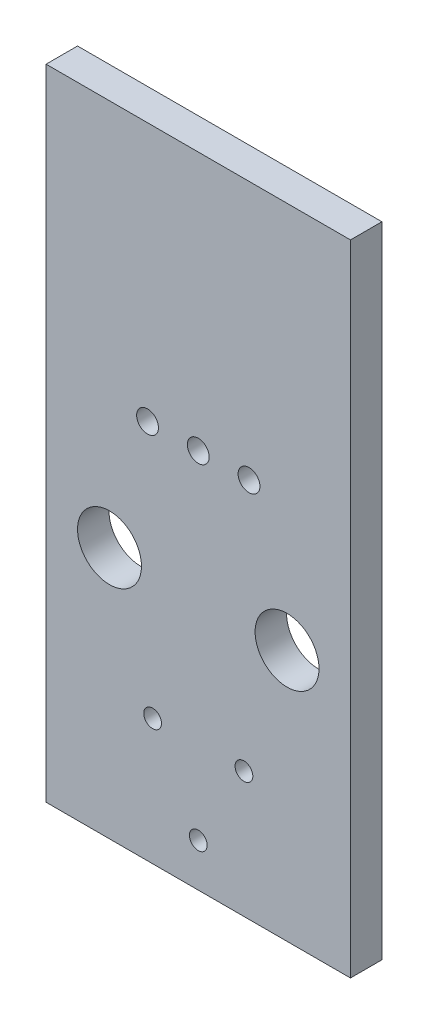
ISO-10303-21;
HEADER;
FILE_DESCRIPTION(('STEP AP214'),'2;1');
FILE_NAME('part.step','',(''),(''),'','','');
FILE_SCHEMA(('AUTOMOTIVE_DESIGN { 1 0 10303 214 1 1 1 1 }'));
ENDSEC;
DATA;
#1=APPLICATION_CONTEXT('core data for automotive mechanical design processes');
#2=APPLICATION_PROTOCOL_DEFINITION('international standard','automotive_design',2000,#1);
#3=PRODUCT_CONTEXT('',#1,'mechanical');
#4=PRODUCT('Part','Part','',(#3));
#5=PRODUCT_RELATED_PRODUCT_CATEGORY('part','',(#4));
#6=PRODUCT_DEFINITION_FORMATION('','',#4);
#7=PRODUCT_DEFINITION_CONTEXT('part definition',#1,'design');
#8=PRODUCT_DEFINITION('design','',#6,#7);
#9=PRODUCT_DEFINITION_SHAPE('','',#8);
#10=(LENGTH_UNIT() NAMED_UNIT(*) SI_UNIT(.MILLI.,.METRE.));
#11=(NAMED_UNIT(*) PLANE_ANGLE_UNIT() SI_UNIT($,.RADIAN.));
#12=(NAMED_UNIT(*) SI_UNIT($,.STERADIAN.) SOLID_ANGLE_UNIT());
#13=UNCERTAINTY_MEASURE_WITH_UNIT(LENGTH_MEASURE(1.E-05),#10,'distance_accuracy_value','');
#14=(GEOMETRIC_REPRESENTATION_CONTEXT(3) GLOBAL_UNCERTAINTY_ASSIGNED_CONTEXT((#13)) GLOBAL_UNIT_ASSIGNED_CONTEXT((#10,
#11,#12)) REPRESENTATION_CONTEXT('',''));
#15=CARTESIAN_POINT('',(0.,0.,0.));
#16=DIRECTION('',(0.,0.,1.));
#17=DIRECTION('',(1.,0.,0.));
#18=AXIS2_PLACEMENT_3D('',#15,#16,#17);
#19=CARTESIAN_POINT('',(15.875,0.,1.5748));
#20=DIRECTION('',(0.,1.,0.));
#21=DIRECTION('',(0.,0.,1.));
#22=AXIS2_PLACEMENT_3D('',#19,#20,#21);
#23=PLANE('',#22);
#24=DIRECTION('',(1.,0.,0.));
#25=VECTOR('',#24,1.);
#26=CARTESIAN_POINT('',(15.875,0.,0.));
#27=LINE('',#26,#25);
#28=CARTESIAN_POINT('',(0.635,0.,0.));
#29=VERTEX_POINT('',#28);
#30=CARTESIAN_POINT('',(15.875,0.,0.));
#31=VERTEX_POINT('',#30);
#32=EDGE_CURVE('E79',#29,#31,#27,.T.);
#33=ORIENTED_EDGE('',*,*,#32,.T.);
#34=DIRECTION('',(0.,0.,-1.));
#35=VECTOR('',#34,1.);
#36=CARTESIAN_POINT('',(15.875,0.,1.5748));
#37=LINE('',#36,#35);
#38=CARTESIAN_POINT('',(15.875,0.,1.5748));
#39=VERTEX_POINT('',#38);
#40=EDGE_CURVE('E11',#39,#31,#37,.T.);
#41=ORIENTED_EDGE('',*,*,#40,.F.);
#42=DIRECTION('',(1.,0.,0.));
#43=VECTOR('',#42,1.);
#44=CARTESIAN_POINT('',(15.875,0.,1.5748));
#45=LINE('',#44,#43);
#46=CARTESIAN_POINT('',(0.635,0.,1.5748));
#47=VERTEX_POINT('',#46);
#48=EDGE_CURVE('E67',#47,#39,#45,.T.);
#49=ORIENTED_EDGE('',*,*,#48,.F.);
#50=DIRECTION('',(0.,0.,-1.));
#51=VECTOR('',#50,1.);
#52=CARTESIAN_POINT('',(0.635,0.,1.5748));
#53=LINE('',#52,#51);
#54=EDGE_CURVE('E75',#47,#29,#53,.T.);
#55=ORIENTED_EDGE('',*,*,#54,.T.);
#56=EDGE_LOOP('',(#33,#41,#49,#55));
#57=FACE_BOUND('',#56,.T.);
#58=ADVANCED_FACE('F16',(#57),#23,.F.);
#59=CARTESIAN_POINT('',(15.875,32.004,1.5748));
#60=DIRECTION('',(-1.,0.,0.));
#61=DIRECTION('',(0.,0.,1.));
#62=AXIS2_PLACEMENT_3D('',#59,#60,#61);
#63=PLANE('',#62);
#64=DIRECTION('',(0.,1.,0.));
#65=VECTOR('',#64,1.);
#66=CARTESIAN_POINT('',(15.875,32.004,0.));
#67=LINE('',#66,#65);
#68=CARTESIAN_POINT('',(15.875,32.004,0.));
#69=VERTEX_POINT('',#68);
#70=EDGE_CURVE('E71',#31,#69,#67,.T.);
#71=ORIENTED_EDGE('',*,*,#70,.T.);
#72=DIRECTION('',(0.,0.,-1.));
#73=VECTOR('',#72,1.);
#74=CARTESIAN_POINT('',(15.875,32.004,1.5748));
#75=LINE('',#74,#73);
#76=CARTESIAN_POINT('',(15.875,32.004,1.5748));
#77=VERTEX_POINT('',#76);
#78=EDGE_CURVE('E24',#77,#69,#75,.T.);
#79=ORIENTED_EDGE('',*,*,#78,.F.);
#80=DIRECTION('',(0.,1.,0.));
#81=VECTOR('',#80,1.);
#82=CARTESIAN_POINT('',(15.875,32.004,1.5748));
#83=LINE('',#82,#81);
#84=EDGE_CURVE('E62',#39,#77,#83,.T.);
#85=ORIENTED_EDGE('',*,*,#84,.F.);
#86=ORIENTED_EDGE('',*,*,#40,.T.);
#87=EDGE_LOOP('',(#71,#79,#85,#86));
#88=FACE_BOUND('',#87,.T.);
#89=ADVANCED_FACE('F70',(#88),#63,.F.);
#90=CARTESIAN_POINT('',(0.635,32.004,1.5748));
#91=DIRECTION('',(0.,-1.,0.));
#92=DIRECTION('',(0.,0.,-1.));
#93=AXIS2_PLACEMENT_3D('',#90,#91,#92);
#94=PLANE('',#93);
#95=DIRECTION('',(-1.,0.,0.));
#96=VECTOR('',#95,1.);
#97=CARTESIAN_POINT('',(0.635,32.004,0.));
#98=LINE('',#97,#96);
#99=CARTESIAN_POINT('',(0.635,32.004,0.));
#100=VERTEX_POINT('',#99);
#101=EDGE_CURVE('E49',#69,#100,#98,.T.);
#102=ORIENTED_EDGE('',*,*,#101,.T.);
#103=DIRECTION('',(0.,0.,-1.));
#104=VECTOR('',#103,1.);
#105=CARTESIAN_POINT('',(0.635,32.004,1.5748));
#106=LINE('',#105,#104);
#107=CARTESIAN_POINT('',(0.635,32.004,1.5748));
#108=VERTEX_POINT('',#107);
#109=EDGE_CURVE('E72',#108,#100,#106,.T.);
#110=ORIENTED_EDGE('',*,*,#109,.F.);
#111=DIRECTION('',(-1.,0.,0.));
#112=VECTOR('',#111,1.);
#113=CARTESIAN_POINT('',(0.635,32.004,1.5748));
#114=LINE('',#113,#112);
#115=EDGE_CURVE('E65',#77,#108,#114,.T.);
#116=ORIENTED_EDGE('',*,*,#115,.F.);
#117=ORIENTED_EDGE('',*,*,#78,.T.);
#118=EDGE_LOOP('',(#102,#110,#116,#117));
#119=FACE_BOUND('',#118,.T.);
#120=ADVANCED_FACE('F73',(#119),#94,.F.);
#121=CARTESIAN_POINT('',(0.635,0.,1.5748));
#122=DIRECTION('',(1.,0.,0.));
#123=DIRECTION('',(0.,0.,-1.));
#124=AXIS2_PLACEMENT_3D('',#121,#122,#123);
#125=PLANE('',#124);
#126=DIRECTION('',(0.,-1.,0.));
#127=VECTOR('',#126,1.);
#128=CARTESIAN_POINT('',(0.635,0.,0.));
#129=LINE('',#128,#127);
#130=EDGE_CURVE('E55',#100,#29,#129,.T.);
#131=ORIENTED_EDGE('',*,*,#130,.T.);
#132=ORIENTED_EDGE('',*,*,#54,.F.);
#133=DIRECTION('',(0.,-1.,0.));
#134=VECTOR('',#133,1.);
#135=CARTESIAN_POINT('',(0.635,0.,1.5748));
#136=LINE('',#135,#134);
#137=EDGE_CURVE('E32',#108,#47,#136,.T.);
#138=ORIENTED_EDGE('',*,*,#137,.F.);
#139=ORIENTED_EDGE('',*,*,#109,.T.);
#140=EDGE_LOOP('',(#131,#132,#138,#139));
#141=FACE_BOUND('',#140,.T.);
#142=ADVANCED_FACE('F87',(#141),#125,.F.);
#143=CARTESIAN_POINT('',(0.,0.,1.5748));
#144=DIRECTION('',(0.,0.,-1.));
#145=DIRECTION('',(-1.,0.,0.));
#146=AXIS2_PLACEMENT_3D('',#143,#144,#145);
#147=PLANE('',#146);
#148=CARTESIAN_POINT('',(10.795,19.05,1.5748));
#149=DIRECTION('',(0.,0.,1.));
#150=DIRECTION('',(1.,0.,0.));
#151=AXIS2_PLACEMENT_3D('',#148,#149,#150);
#152=CIRCLE('',#151,0.546100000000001);
#153=CARTESIAN_POINT('',(11.3411,19.05,1.5748));
#154=VERTEX_POINT('',#153);
#155=EDGE_CURVE('E120',#154,#154,#152,.T.);
#156=ORIENTED_EDGE('',*,*,#155,.F.);
#157=EDGE_LOOP('',(#156));
#158=FACE_BOUND('',#157,.T.);
#159=CARTESIAN_POINT('',(8.255,19.05,1.5748));
#160=DIRECTION('',(0.,0.,1.));
#161=DIRECTION('',(1.,0.,0.));
#162=AXIS2_PLACEMENT_3D('',#159,#160,#161);
#163=CIRCLE('',#162,0.546100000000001);
#164=CARTESIAN_POINT('',(8.8011,19.05,1.5748));
#165=VERTEX_POINT('',#164);
#166=EDGE_CURVE('E126',#165,#165,#163,.T.);
#167=ORIENTED_EDGE('',*,*,#166,.F.);
#168=EDGE_LOOP('',(#167));
#169=FACE_BOUND('',#168,.T.);
#170=CARTESIAN_POINT('',(5.715,19.05,1.5748));
#171=DIRECTION('',(0.,0.,1.));
#172=DIRECTION('',(1.,0.,0.));
#173=AXIS2_PLACEMENT_3D('',#170,#171,#172);
#174=CIRCLE('',#173,0.5461);
#175=CARTESIAN_POINT('',(6.2611,19.05,1.5748));
#176=VERTEX_POINT('',#175);
#177=EDGE_CURVE('E132',#176,#176,#174,.T.);
#178=ORIENTED_EDGE('',*,*,#177,.F.);
#179=EDGE_LOOP('',(#178));
#180=FACE_BOUND('',#179,.T.);
#181=CARTESIAN_POINT('',(3.81,12.6238,1.5748));
#182=DIRECTION('',(0.,0.,1.));
#183=DIRECTION('',(1.,0.,0.));
#184=AXIS2_PLACEMENT_3D('',#181,#182,#183);
#185=CIRCLE('',#184,1.6002);
#186=CARTESIAN_POINT('',(5.4102,12.6238,1.5748));
#187=VERTEX_POINT('',#186);
#188=EDGE_CURVE('E103',#187,#187,#185,.T.);
#189=ORIENTED_EDGE('',*,*,#188,.F.);
#190=EDGE_LOOP('',(#189));
#191=FACE_BOUND('',#190,.T.);
#192=CARTESIAN_POINT('',(12.7,12.6238,1.5748));
#193=DIRECTION('',(0.,0.,1.));
#194=DIRECTION('',(1.,0.,0.));
#195=AXIS2_PLACEMENT_3D('',#192,#193,#194);
#196=CIRCLE('',#195,1.6002);
#197=CARTESIAN_POINT('',(14.3002,12.6238,1.5748));
#198=VERTEX_POINT('',#197);
#199=EDGE_CURVE('E102',#198,#198,#196,.T.);
#200=ORIENTED_EDGE('',*,*,#199,.F.);
#201=EDGE_LOOP('',(#200));
#202=FACE_BOUND('',#201,.T.);
#203=CARTESIAN_POINT('',(5.969,6.30428,1.5748));
#204=DIRECTION('',(0.,0.,1.));
#205=DIRECTION('',(1.,0.,0.));
#206=AXIS2_PLACEMENT_3D('',#203,#204,#205);
#207=CIRCLE('',#206,0.4445);
#208=CARTESIAN_POINT('',(6.4135,6.30428,1.5748));
#209=VERTEX_POINT('',#208);
#210=EDGE_CURVE('E109',#209,#209,#207,.T.);
#211=ORIENTED_EDGE('',*,*,#210,.F.);
#212=EDGE_LOOP('',(#211));
#213=FACE_BOUND('',#212,.T.);
#214=CARTESIAN_POINT('',(8.255,2.159,1.5748));
#215=DIRECTION('',(0.,0.,1.));
#216=DIRECTION('',(1.,0.,0.));
#217=AXIS2_PLACEMENT_3D('',#214,#215,#216);
#218=CIRCLE('',#217,0.4445);
#219=CARTESIAN_POINT('',(8.6995,2.159,1.5748));
#220=VERTEX_POINT('',#219);
#221=EDGE_CURVE('E96',#220,#220,#218,.T.);
#222=ORIENTED_EDGE('',*,*,#221,.F.);
#223=EDGE_LOOP('',(#222));
#224=FACE_BOUND('',#223,.T.);
#225=CARTESIAN_POINT('',(10.541,6.30428,1.5748));
#226=DIRECTION('',(0.,0.,1.));
#227=DIRECTION('',(1.,0.,0.));
#228=AXIS2_PLACEMENT_3D('',#225,#226,#227);
#229=CIRCLE('',#228,0.4445);
#230=CARTESIAN_POINT('',(10.9855,6.30428,1.5748));
#231=VERTEX_POINT('',#230);
#232=EDGE_CURVE('E82',#231,#231,#229,.T.);
#233=ORIENTED_EDGE('',*,*,#232,.F.);
#234=EDGE_LOOP('',(#233));
#235=FACE_BOUND('',#234,.T.);
#236=ORIENTED_EDGE('',*,*,#48,.T.);
#237=ORIENTED_EDGE('',*,*,#84,.T.);
#238=ORIENTED_EDGE('',*,*,#115,.T.);
#239=ORIENTED_EDGE('',*,*,#137,.T.);
#240=EDGE_LOOP('',(#236,#237,#238,#239));
#241=FACE_BOUND('',#240,.T.);
#242=ADVANCED_FACE('F63',(#158,#169,#180,#191,#202,#213,#224,#235,#241),#147,.F.);
#243=CARTESIAN_POINT('',(0.,0.,0.));
#244=DIRECTION('',(0.,0.,-1.));
#245=DIRECTION('',(-1.,0.,0.));
#246=AXIS2_PLACEMENT_3D('',#243,#244,#245);
#247=PLANE('',#246);
#248=CARTESIAN_POINT('',(10.795,19.05,0.));
#249=DIRECTION('',(0.,0.,1.));
#250=DIRECTION('',(1.,0.,0.));
#251=AXIS2_PLACEMENT_3D('',#248,#249,#250);
#252=CIRCLE('',#251,0.546100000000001);
#253=CARTESIAN_POINT('',(11.3411,19.05,0.));
#254=VERTEX_POINT('',#253);
#255=EDGE_CURVE('E117',#254,#254,#252,.T.);
#256=ORIENTED_EDGE('',*,*,#255,.T.);
#257=EDGE_LOOP('',(#256));
#258=FACE_BOUND('',#257,.T.);
#259=CARTESIAN_POINT('',(8.255,19.05,0.));
#260=DIRECTION('',(0.,0.,1.));
#261=DIRECTION('',(1.,0.,0.));
#262=AXIS2_PLACEMENT_3D('',#259,#260,#261);
#263=CIRCLE('',#262,0.546100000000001);
#264=CARTESIAN_POINT('',(8.8011,19.05,0.));
#265=VERTEX_POINT('',#264);
#266=EDGE_CURVE('E123',#265,#265,#263,.T.);
#267=ORIENTED_EDGE('',*,*,#266,.T.);
#268=EDGE_LOOP('',(#267));
#269=FACE_BOUND('',#268,.T.);
#270=CARTESIAN_POINT('',(5.715,19.05,0.));
#271=DIRECTION('',(0.,0.,1.));
#272=DIRECTION('',(1.,0.,0.));
#273=AXIS2_PLACEMENT_3D('',#270,#271,#272);
#274=CIRCLE('',#273,0.5461);
#275=CARTESIAN_POINT('',(6.2611,19.05,0.));
#276=VERTEX_POINT('',#275);
#277=EDGE_CURVE('E129',#276,#276,#274,.T.);
#278=ORIENTED_EDGE('',*,*,#277,.T.);
#279=EDGE_LOOP('',(#278));
#280=FACE_BOUND('',#279,.T.);
#281=CARTESIAN_POINT('',(3.81,12.6238,0.));
#282=DIRECTION('',(0.,0.,1.));
#283=DIRECTION('',(1.,0.,0.));
#284=AXIS2_PLACEMENT_3D('',#281,#282,#283);
#285=CIRCLE('',#284,1.6002);
#286=CARTESIAN_POINT('',(5.4102,12.6238,0.));
#287=VERTEX_POINT('',#286);
#288=EDGE_CURVE('E135',#287,#287,#285,.T.);
#289=ORIENTED_EDGE('',*,*,#288,.T.);
#290=EDGE_LOOP('',(#289));
#291=FACE_BOUND('',#290,.T.);
#292=CARTESIAN_POINT('',(12.7,12.6238,0.));
#293=DIRECTION('',(0.,0.,1.));
#294=DIRECTION('',(1.,0.,0.));
#295=AXIS2_PLACEMENT_3D('',#292,#293,#294);
#296=CIRCLE('',#295,1.6002);
#297=CARTESIAN_POINT('',(14.3002,12.6238,0.));
#298=VERTEX_POINT('',#297);
#299=EDGE_CURVE('E99',#298,#298,#296,.T.);
#300=ORIENTED_EDGE('',*,*,#299,.T.);
#301=EDGE_LOOP('',(#300));
#302=FACE_BOUND('',#301,.T.);
#303=CARTESIAN_POINT('',(5.969,6.30428,0.));
#304=DIRECTION('',(0.,0.,1.));
#305=DIRECTION('',(1.,0.,0.));
#306=AXIS2_PLACEMENT_3D('',#303,#304,#305);
#307=CIRCLE('',#306,0.4445);
#308=CARTESIAN_POINT('',(6.4135,6.30428,0.));
#309=VERTEX_POINT('',#308);
#310=EDGE_CURVE('E106',#309,#309,#307,.T.);
#311=ORIENTED_EDGE('',*,*,#310,.T.);
#312=EDGE_LOOP('',(#311));
#313=FACE_BOUND('',#312,.T.);
#314=CARTESIAN_POINT('',(8.255,2.159,0.));
#315=DIRECTION('',(0.,0.,1.));
#316=DIRECTION('',(1.,0.,0.));
#317=AXIS2_PLACEMENT_3D('',#314,#315,#316);
#318=CIRCLE('',#317,0.4445);
#319=CARTESIAN_POINT('',(8.6995,2.159,0.));
#320=VERTEX_POINT('',#319);
#321=EDGE_CURVE('E112',#320,#320,#318,.T.);
#322=ORIENTED_EDGE('',*,*,#321,.T.);
#323=EDGE_LOOP('',(#322));
#324=FACE_BOUND('',#323,.T.);
#325=CARTESIAN_POINT('',(10.541,6.30428,0.));
#326=DIRECTION('',(0.,0.,1.));
#327=DIRECTION('',(1.,0.,0.));
#328=AXIS2_PLACEMENT_3D('',#325,#326,#327);
#329=CIRCLE('',#328,0.4445);
#330=CARTESIAN_POINT('',(10.9855,6.30428,0.));
#331=VERTEX_POINT('',#330);
#332=EDGE_CURVE('E93',#331,#331,#329,.T.);
#333=ORIENTED_EDGE('',*,*,#332,.T.);
#334=EDGE_LOOP('',(#333));
#335=FACE_BOUND('',#334,.T.);
#336=ORIENTED_EDGE('',*,*,#32,.F.);
#337=ORIENTED_EDGE('',*,*,#130,.F.);
#338=ORIENTED_EDGE('',*,*,#101,.F.);
#339=ORIENTED_EDGE('',*,*,#70,.F.);
#340=EDGE_LOOP('',(#336,#337,#338,#339));
#341=FACE_BOUND('',#340,.T.);
#342=ADVANCED_FACE('F90',(#258,#269,#280,#291,#302,#313,#324,#335,#341),#247,.T.);
#343=CARTESIAN_POINT('',(10.541,6.30428,1.5748));
#344=DIRECTION('',(0.,0.,-1.));
#345=DIRECTION('',(-1.,0.,0.));
#346=AXIS2_PLACEMENT_3D('',#343,#344,#345);
#347=CYLINDRICAL_SURFACE('',#346,0.4445);
#348=ORIENTED_EDGE('',*,*,#232,.T.);
#349=EDGE_LOOP('',(#348));
#350=FACE_BOUND('',#349,.T.);
#351=ORIENTED_EDGE('',*,*,#332,.F.);
#352=EDGE_LOOP('',(#351));
#353=FACE_BOUND('',#352,.T.);
#354=ADVANCED_FACE('F156',(#350,#353),#347,.F.);
#355=CARTESIAN_POINT('',(8.255,2.159,1.5748));
#356=DIRECTION('',(0.,0.,-1.));
#357=DIRECTION('',(-1.,0.,0.));
#358=AXIS2_PLACEMENT_3D('',#355,#356,#357);
#359=CYLINDRICAL_SURFACE('',#358,0.4445);
#360=ORIENTED_EDGE('',*,*,#221,.T.);
#361=EDGE_LOOP('',(#360));
#362=FACE_BOUND('',#361,.T.);
#363=ORIENTED_EDGE('',*,*,#321,.F.);
#364=EDGE_LOOP('',(#363));
#365=FACE_BOUND('',#364,.T.);
#366=ADVANCED_FACE('F159',(#362,#365),#359,.F.);
#367=CARTESIAN_POINT('',(5.969,6.30428,1.5748));
#368=DIRECTION('',(0.,0.,-1.));
#369=DIRECTION('',(-1.,0.,0.));
#370=AXIS2_PLACEMENT_3D('',#367,#368,#369);
#371=CYLINDRICAL_SURFACE('',#370,0.4445);
#372=ORIENTED_EDGE('',*,*,#210,.T.);
#373=EDGE_LOOP('',(#372));
#374=FACE_BOUND('',#373,.T.);
#375=ORIENTED_EDGE('',*,*,#310,.F.);
#376=EDGE_LOOP('',(#375));
#377=FACE_BOUND('',#376,.T.);
#378=ADVANCED_FACE('F215',(#374,#377),#371,.F.);
#379=CARTESIAN_POINT('',(12.7,12.6238,1.5748));
#380=DIRECTION('',(0.,0.,-1.));
#381=DIRECTION('',(-1.,0.,0.));
#382=AXIS2_PLACEMENT_3D('',#379,#380,#381);
#383=CYLINDRICAL_SURFACE('',#382,1.6002);
#384=ORIENTED_EDGE('',*,*,#199,.T.);
#385=EDGE_LOOP('',(#384));
#386=FACE_BOUND('',#385,.T.);
#387=ORIENTED_EDGE('',*,*,#299,.F.);
#388=EDGE_LOOP('',(#387));
#389=FACE_BOUND('',#388,.T.);
#390=ADVANCED_FACE('F226',(#386,#389),#383,.F.);
#391=CARTESIAN_POINT('',(3.81,12.6238,1.5748));
#392=DIRECTION('',(0.,0.,-1.));
#393=DIRECTION('',(-1.,0.,0.));
#394=AXIS2_PLACEMENT_3D('',#391,#392,#393);
#395=CYLINDRICAL_SURFACE('',#394,1.6002);
#396=ORIENTED_EDGE('',*,*,#188,.T.);
#397=EDGE_LOOP('',(#396));
#398=FACE_BOUND('',#397,.T.);
#399=ORIENTED_EDGE('',*,*,#288,.F.);
#400=EDGE_LOOP('',(#399));
#401=FACE_BOUND('',#400,.T.);
#402=ADVANCED_FACE('F141',(#398,#401),#395,.F.);
#403=CARTESIAN_POINT('',(5.715,19.05,1.5748));
#404=DIRECTION('',(0.,0.,-1.));
#405=DIRECTION('',(-1.,0.,0.));
#406=AXIS2_PLACEMENT_3D('',#403,#404,#405);
#407=CYLINDRICAL_SURFACE('',#406,0.5461);
#408=ORIENTED_EDGE('',*,*,#177,.T.);
#409=EDGE_LOOP('',(#408));
#410=FACE_BOUND('',#409,.T.);
#411=ORIENTED_EDGE('',*,*,#277,.F.);
#412=EDGE_LOOP('',(#411));
#413=FACE_BOUND('',#412,.T.);
#414=ADVANCED_FACE('F247',(#410,#413),#407,.F.);
#415=CARTESIAN_POINT('',(8.255,19.05,1.5748));
#416=DIRECTION('',(0.,0.,-1.));
#417=DIRECTION('',(-1.,0.,0.));
#418=AXIS2_PLACEMENT_3D('',#415,#416,#417);
#419=CYLINDRICAL_SURFACE('',#418,0.546100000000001);
#420=ORIENTED_EDGE('',*,*,#166,.T.);
#421=EDGE_LOOP('',(#420));
#422=FACE_BOUND('',#421,.T.);
#423=ORIENTED_EDGE('',*,*,#266,.F.);
#424=EDGE_LOOP('',(#423));
#425=FACE_BOUND('',#424,.T.);
#426=ADVANCED_FACE('F257',(#422,#425),#419,.F.);
#427=CARTESIAN_POINT('',(10.795,19.05,1.5748));
#428=DIRECTION('',(0.,0.,-1.));
#429=DIRECTION('',(-1.,0.,0.));
#430=AXIS2_PLACEMENT_3D('',#427,#428,#429);
#431=CYLINDRICAL_SURFACE('',#430,0.546100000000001);
#432=ORIENTED_EDGE('',*,*,#155,.T.);
#433=EDGE_LOOP('',(#432));
#434=FACE_BOUND('',#433,.T.);
#435=ORIENTED_EDGE('',*,*,#255,.F.);
#436=EDGE_LOOP('',(#435));
#437=FACE_BOUND('',#436,.T.);
#438=ADVANCED_FACE('F268',(#434,#437),#431,.F.);
#439=CLOSED_SHELL('',(#58,#89,#120,#142,#242,#342,#354,#366,#378,#390,#402,#414,#426,#438));
#440=MANIFOLD_SOLID_BREP('B1',#439);
#441=ADVANCED_BREP_SHAPE_REPRESENTATION('',(#18,#440),#14);
#442=SHAPE_DEFINITION_REPRESENTATION(#9,#441);
ENDSEC;
END-ISO-10303-21;
